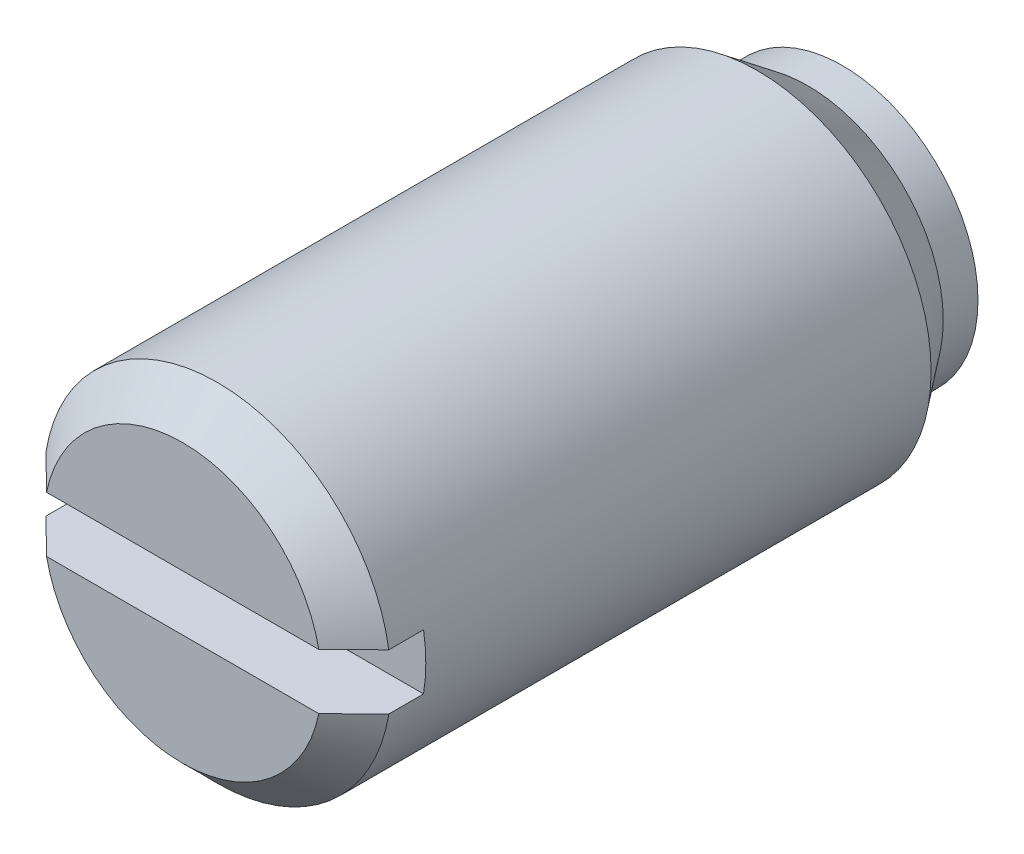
ISO-10303-21;
HEADER;
FILE_DESCRIPTION(('STEP AP214'),'2;1');
FILE_NAME('part.step','',(''),(''),'','','');
FILE_SCHEMA(('AUTOMOTIVE_DESIGN { 1 0 10303 214 1 1 1 1 }'));
ENDSEC;
DATA;
#1=APPLICATION_CONTEXT('core data for automotive mechanical design processes');
#2=APPLICATION_PROTOCOL_DEFINITION('international standard','automotive_design',2000,#1);
#3=PRODUCT_CONTEXT('',#1,'mechanical');
#4=PRODUCT('Part','Part','',(#3));
#5=PRODUCT_RELATED_PRODUCT_CATEGORY('part','',(#4));
#6=PRODUCT_DEFINITION_FORMATION('','',#4);
#7=PRODUCT_DEFINITION_CONTEXT('part definition',#1,'design');
#8=PRODUCT_DEFINITION('design','',#6,#7);
#9=PRODUCT_DEFINITION_SHAPE('','',#8);
#10=(LENGTH_UNIT() NAMED_UNIT(*) SI_UNIT(.MILLI.,.METRE.));
#11=(NAMED_UNIT(*) PLANE_ANGLE_UNIT() SI_UNIT($,.RADIAN.));
#12=(NAMED_UNIT(*) SI_UNIT($,.STERADIAN.) SOLID_ANGLE_UNIT());
#13=UNCERTAINTY_MEASURE_WITH_UNIT(LENGTH_MEASURE(1.E-05),#10,'distance_accuracy_value','');
#14=(GEOMETRIC_REPRESENTATION_CONTEXT(3) GLOBAL_UNCERTAINTY_ASSIGNED_CONTEXT((#13)) GLOBAL_UNIT_ASSIGNED_CONTEXT((#10,
#11,#12)) REPRESENTATION_CONTEXT('',''));
#15=CARTESIAN_POINT('',(0.,0.,0.));
#16=DIRECTION('',(0.,0.,1.));
#17=DIRECTION('',(1.,0.,0.));
#18=AXIS2_PLACEMENT_3D('',#15,#16,#17);
#19=CARTESIAN_POINT('',(0.,0.,1.));
#20=DIRECTION('',(0.,0.,-1.));
#21=DIRECTION('',(-1.,0.,0.));
#22=AXIS2_PLACEMENT_3D('',#19,#20,#21);
#23=CYLINDRICAL_SURFACE('',#22,5.);
#24=CARTESIAN_POINT('',(0.,0.,4.45));
#25=DIRECTION('',(0.,0.,1.));
#26=DIRECTION('',(1.,0.,0.));
#27=AXIS2_PLACEMENT_3D('',#24,#25,#26);
#28=CIRCLE('',#27,5.);
#29=CARTESIAN_POINT('',(5.,0.,4.45));
#30=VERTEX_POINT('',#29);
#31=EDGE_CURVE('E78',#30,#30,#28,.T.);
#32=ORIENTED_EDGE('',*,*,#31,.T.);
#33=EDGE_LOOP('',(#32));
#34=FACE_BOUND('',#33,.T.);
#35=DIRECTION('',(0.,0.,1.));
#36=VECTOR('',#35,1.);
#37=CARTESIAN_POINT('',(-4.93558507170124,0.8,19.));
#38=LINE('',#37,#36);
#39=CARTESIAN_POINT('',(-4.93558507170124,0.8,19.));
#40=VERTEX_POINT('',#39);
#41=CARTESIAN_POINT('',(-4.93558507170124,0.8,20.));
#42=VERTEX_POINT('',#41);
#43=EDGE_CURVE('E87',#40,#42,#38,.T.);
#44=ORIENTED_EDGE('',*,*,#43,.T.);
#45=CARTESIAN_POINT('',(0.,0.,20.));
#46=DIRECTION('',(0.,0.,1.));
#47=DIRECTION('',(1.,0.,0.));
#48=AXIS2_PLACEMENT_3D('',#45,#46,#47);
#49=CIRCLE('',#48,5.);
#50=CARTESIAN_POINT('',(4.93558507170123,0.8,20.));
#51=VERTEX_POINT('',#50);
#52=EDGE_CURVE('E35',#51,#42,#49,.T.);
#53=ORIENTED_EDGE('',*,*,#52,.F.);
#54=DIRECTION('',(0.,0.,1.));
#55=VECTOR('',#54,1.);
#56=CARTESIAN_POINT('',(4.93558507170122,0.8,19.));
#57=LINE('',#56,#55);
#58=CARTESIAN_POINT('',(4.93558507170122,0.8,19.));
#59=VERTEX_POINT('',#58);
#60=EDGE_CURVE('E85',#59,#51,#57,.T.);
#61=ORIENTED_EDGE('',*,*,#60,.F.);
#62=CARTESIAN_POINT('',(0.,0.,19.));
#63=DIRECTION('',(0.,0.,1.));
#64=DIRECTION('',(1.,0.,0.));
#65=AXIS2_PLACEMENT_3D('',#62,#63,#64);
#66=CIRCLE('',#65,5.);
#67=CARTESIAN_POINT('',(4.93558507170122,-0.8,19.));
#68=VERTEX_POINT('',#67);
#69=EDGE_CURVE('E117',#68,#59,#66,.T.);
#70=ORIENTED_EDGE('',*,*,#69,.F.);
#71=DIRECTION('',(0.,0.,1.));
#72=VECTOR('',#71,1.);
#73=CARTESIAN_POINT('',(4.93558507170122,-0.8,19.));
#74=LINE('',#73,#72);
#75=CARTESIAN_POINT('',(4.93558507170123,-0.8,20.));
#76=VERTEX_POINT('',#75);
#77=EDGE_CURVE('E94',#68,#76,#74,.T.);
#78=ORIENTED_EDGE('',*,*,#77,.T.);
#79=CARTESIAN_POINT('',(-4.93558507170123,-0.8,20.));
#80=VERTEX_POINT('',#79);
#81=EDGE_CURVE('E88',#80,#76,#49,.T.);
#82=ORIENTED_EDGE('',*,*,#81,.F.);
#83=DIRECTION('',(0.,0.,1.));
#84=VECTOR('',#83,1.);
#85=CARTESIAN_POINT('',(-4.93558507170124,-0.8,19.));
#86=LINE('',#85,#84);
#87=CARTESIAN_POINT('',(-4.93558507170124,-0.8,19.));
#88=VERTEX_POINT('',#87);
#89=EDGE_CURVE('E99',#88,#80,#86,.T.);
#90=ORIENTED_EDGE('',*,*,#89,.F.);
#91=EDGE_CURVE('E121',#40,#88,#66,.T.);
#92=ORIENTED_EDGE('',*,*,#91,.F.);
#93=EDGE_LOOP('',(#44,#53,#61,#70,#78,#82,#90,#92));
#94=FACE_BOUND('',#93,.T.);
#95=ADVANCED_FACE('F14',(#34,#94),#23,.T.);
#96=CARTESIAN_POINT('',(0.,5.,21.));
#97=DIRECTION('',(0.,0.,1.));
#98=DIRECTION('',(1.,0.,0.));
#99=AXIS2_PLACEMENT_3D('',#96,#97,#98);
#100=PLANE('',#99);
#101=DIRECTION('',(1.,0.,0.));
#102=VECTOR('',#101,1.);
#103=CARTESIAN_POINT('',(-4.93558507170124,0.8,21.));
#104=LINE('',#103,#102);
#105=CARTESIAN_POINT('',(-3.91918358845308,0.8,21.));
#106=VERTEX_POINT('',#105);
#107=CARTESIAN_POINT('',(3.91918358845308,0.8,21.));
#108=VERTEX_POINT('',#107);
#109=EDGE_CURVE('E123',#106,#108,#104,.T.);
#110=ORIENTED_EDGE('',*,*,#109,.T.);
#111=CARTESIAN_POINT('',(0.,0.,21.));
#112=DIRECTION('',(0.,0.,1.));
#113=DIRECTION('',(1.,0.,0.));
#114=AXIS2_PLACEMENT_3D('',#111,#112,#113);
#115=CIRCLE('',#114,4.);
#116=EDGE_CURVE('E73',#108,#106,#115,.T.);
#117=ORIENTED_EDGE('',*,*,#116,.T.);
#118=EDGE_LOOP('',(#110,#117));
#119=FACE_BOUND('',#118,.T.);
#120=ADVANCED_FACE('F165',(#119),#100,.T.);
#121=DIRECTION('',(1.,0.,0.));
#122=VECTOR('',#121,1.);
#123=CARTESIAN_POINT('',(-4.93558507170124,-0.8,21.));
#124=LINE('',#123,#122);
#125=CARTESIAN_POINT('',(-3.91918358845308,-0.8,21.));
#126=VERTEX_POINT('',#125);
#127=CARTESIAN_POINT('',(3.91918358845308,-0.8,21.));
#128=VERTEX_POINT('',#127);
#129=EDGE_CURVE('E125',#126,#128,#124,.T.);
#130=ORIENTED_EDGE('',*,*,#129,.F.);
#131=EDGE_CURVE('E42',#126,#128,#115,.T.);
#132=ORIENTED_EDGE('',*,*,#131,.T.);
#133=EDGE_LOOP('',(#130,#132));
#134=FACE_BOUND('',#133,.T.);
#135=ADVANCED_FACE('F163',(#134),#100,.T.);
#136=CARTESIAN_POINT('',(-4.93558507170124,0.8,19.));
#137=DIRECTION('',(0.,-1.,0.));
#138=DIRECTION('',(1.,0.,0.));
#139=AXIS2_PLACEMENT_3D('',#136,#137,#138);
#140=PLANE('',#139);
#141=ORIENTED_EDGE('',*,*,#60,.T.);
#142=CARTESIAN_POINT('',(10.8888011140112,0.8,14.0818504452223));
#143=CARTESIAN_POINT('',(10.5091335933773,0.799999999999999,14.4604890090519));
#144=CARTESIAN_POINT('',(10.1294208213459,0.799999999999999,14.8390822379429));
#145=CARTESIAN_POINT('',(9.369833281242,0.799999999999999,15.596130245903));
#146=CARTESIAN_POINT('',(8.98995850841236,0.799999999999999,15.9745850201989));
#147=CARTESIAN_POINT('',(8.22971772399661,0.799999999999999,16.7315649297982));
#148=CARTESIAN_POINT('',(7.84935155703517,0.799999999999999,17.1100899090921));
#149=CARTESIAN_POINT('',(7.08830903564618,0.799999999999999,17.8668044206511));
#150=CARTESIAN_POINT('',(6.70763269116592,0.799999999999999,18.2449939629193));
#151=CARTESIAN_POINT('',(5.95065413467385,0.799999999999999,18.996000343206));
#152=CARTESIAN_POINT('',(5.57435851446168,0.799999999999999,19.3688238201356));
#153=CARTESIAN_POINT('',(5.00921367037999,0.799999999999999,19.9273853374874));
#154=CARTESIAN_POINT('',(4.82070618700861,0.799999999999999,20.1134690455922));
#155=CARTESIAN_POINT('',(4.44336739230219,0.799999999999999,20.4853044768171));
#156=CARTESIAN_POINT('',(4.25453608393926,0.799999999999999,20.6710562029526));
#157=CARTESIAN_POINT('',(3.87648764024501,0.799999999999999,21.0419934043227));
#158=CARTESIAN_POINT('',(3.68727072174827,0.799999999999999,21.2271791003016));
#159=CARTESIAN_POINT('',(3.30809823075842,0.799999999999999,21.5968062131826));
#160=CARTESIAN_POINT('',(3.11814263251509,0.799999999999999,21.7812476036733));
#161=CARTESIAN_POINT('',(2.73706890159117,0.8,22.1488675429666));
#162=CARTESIAN_POINT('',(2.54595096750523,0.8,22.3320462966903));
#163=CARTESIAN_POINT('',(2.25760193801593,0.799999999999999,22.6050390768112));
#164=CARTESIAN_POINT('',(2.16120963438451,0.799999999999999,22.6957382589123));
#165=CARTESIAN_POINT('',(1.9676117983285,0.8,22.8762637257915));
#166=CARTESIAN_POINT('',(1.87040628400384,0.8,22.9660900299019));
#167=CARTESIAN_POINT('',(1.74579873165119,0.8,23.0796629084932));
#168=CARTESIAN_POINT('',(1.71896253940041,0.8,23.1040304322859));
#169=CARTESIAN_POINT('',(1.66518446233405,0.799999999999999,23.1526487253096));
#170=CARTESIAN_POINT('',(1.63824257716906,0.8,23.176899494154));
#171=CARTESIAN_POINT('',(1.55723574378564,0.8,23.2494559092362));
#172=CARTESIAN_POINT('',(1.50299247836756,0.8,23.2975630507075));
#173=CARTESIAN_POINT('',(1.39371516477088,0.8,23.3932202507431));
#174=CARTESIAN_POINT('',(1.33867917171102,0.799999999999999,23.4407680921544));
#175=CARTESIAN_POINT('',(1.2277806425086,0.8,23.5348780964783));
#176=CARTESIAN_POINT('',(1.17191822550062,0.8,23.5814403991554));
#177=CARTESIAN_POINT('',(1.06388676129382,0.8,23.6692294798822));
#178=CARTESIAN_POINT('',(1.0118117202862,0.8,23.7105714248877));
#179=CARTESIAN_POINT('',(0.906358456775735,0.799999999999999,23.791554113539));
#180=CARTESIAN_POINT('',(0.852980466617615,0.8,23.8311951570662));
#181=CARTESIAN_POINT('',(0.744493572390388,0.8,23.9078485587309));
#182=CARTESIAN_POINT('',(0.689387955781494,0.8,23.944865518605));
#183=CARTESIAN_POINT('',(0.576673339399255,0.8,24.0148131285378));
#184=CARTESIAN_POINT('',(0.519067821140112,0.8,24.0477492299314));
#185=CARTESIAN_POINT('',(0.408839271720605,0.8,24.1026678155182));
#186=CARTESIAN_POINT('',(0.35667372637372,0.8,24.1255420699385));
#187=CARTESIAN_POINT('',(0.249613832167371,0.8,24.1634394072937));
#188=CARTESIAN_POINT('',(0.194730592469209,0.8,24.1784919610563));
#189=CARTESIAN_POINT('',(0.092296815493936,0.8,24.1959939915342));
#190=CARTESIAN_POINT('',(0.0450481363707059,0.8,24.2001254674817));
#191=CARTESIAN_POINT('',(-0.0493940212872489,0.8,24.1998686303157));
#192=CARTESIAN_POINT('',(-0.0965875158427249,0.8,24.1954848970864));
#193=CARTESIAN_POINT('',(-0.204243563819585,0.8,24.1765456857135));
#194=CARTESIAN_POINT('',(-0.26420199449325,0.8,24.1592205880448));
#195=CARTESIAN_POINT('',(-0.351611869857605,0.8,24.1265666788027));
#196=CARTESIAN_POINT('',(-0.380416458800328,0.8,24.1145209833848));
#197=CARTESIAN_POINT('',(-0.437224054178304,0.8,24.0886662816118));
#198=CARTESIAN_POINT('',(-0.465227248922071,0.8,24.0748576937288));
#199=CARTESIAN_POINT('',(-0.541425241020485,0.8,24.03489806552));
#200=CARTESIAN_POINT('',(-0.588861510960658,0.8,24.007315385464));
#201=CARTESIAN_POINT('',(-0.682018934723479,0.8,23.9493693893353));
#202=CARTESIAN_POINT('',(-0.727738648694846,0.8,23.9190038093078));
#203=CARTESIAN_POINT('',(-0.817970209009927,0.8,23.8563128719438));
#204=CARTESIAN_POINT('',(-0.862478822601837,0.8,23.823982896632));
#205=CARTESIAN_POINT('',(-0.950496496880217,0.8,23.7579849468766));
#206=CARTESIAN_POINT('',(-0.994005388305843,0.8,23.7243167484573));
#207=CARTESIAN_POINT('',(-1.12386825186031,0.8,23.6215076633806));
#208=CARTESIAN_POINT('',(-1.20906998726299,0.8,23.5509148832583));
#209=CARTESIAN_POINT('',(-1.33539455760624,0.8,23.4434624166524));
#210=CARTESIAN_POINT('',(-1.3772220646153,0.8,23.4074151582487));
#211=CARTESIAN_POINT('',(-1.46049378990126,0.8,23.3348814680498));
#212=CARTESIAN_POINT('',(-1.50193802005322,0.8,23.2983950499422));
#213=CARTESIAN_POINT('',(-1.62458947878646,0.8,23.1895074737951));
#214=CARTESIAN_POINT('',(-1.7053569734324,0.8,23.116611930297));
#215=CARTESIAN_POINT('',(-1.86607972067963,0.8,22.96992923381));
#216=CARTESIAN_POINT('',(-1.94603494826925,0.8,22.8961420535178));
#217=CARTESIAN_POINT('',(-2.18505673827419,0.8,22.6738450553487));
#218=CARTESIAN_POINT('',(-2.34326459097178,0.8,22.5244131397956));
#219=CARTESIAN_POINT('',(-2.65855067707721,0.8,22.224096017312));
#220=CARTESIAN_POINT('',(-2.81562780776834,0.8,22.0732096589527));
#221=CARTESIAN_POINT('',(-3.12898101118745,0.8,21.7706248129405));
#222=CARTESIAN_POINT('',(-3.28525712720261,0.8,21.6189263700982));
#223=CARTESIAN_POINT('',(-3.5963235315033,0.8,21.3159372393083));
#224=CARTESIAN_POINT('',(-3.7511170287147,0.8,21.1646498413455));
#225=CARTESIAN_POINT('',(-4.06034778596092,0.8,20.861707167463));
#226=CARTESIAN_POINT('',(-4.2147850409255,0.8,20.7100518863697));
#227=CARTESIAN_POINT('',(-4.67761164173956,0.8,20.2547991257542));
#228=CARTESIAN_POINT('',(-4.98561923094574,0.8,19.9508136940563));
#229=CARTESIAN_POINT('',(-5.75919415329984,0.8,19.1859244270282));
#230=CARTESIAN_POINT('',(-6.22439714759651,0.8,18.7246524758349));
#231=CARTESIAN_POINT('',(-7.15421506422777,0.8,17.801399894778));
#232=CARTESIAN_POINT('',(-7.61882990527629,0.8,17.3394191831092));
#233=CARTESIAN_POINT('',(-8.5511707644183,0.8,16.4116140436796));
#234=CARTESIAN_POINT('',(-9.01889396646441,0.8,15.9457867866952));
#235=CARTESIAN_POINT('',(-9.95403142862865,0.8,15.0139427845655));
#236=CARTESIAN_POINT('',(-10.4214457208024,0.8,14.5479260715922));
#237=CARTESIAN_POINT('',(-10.8888011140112,0.8,14.0818504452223));
#238=B_SPLINE_CURVE_WITH_KNOTS('',3,(#142,#143,#144,#145,#146,#147,#148,#149,#150,#151,#152,
#153,#154,#155,#156,#157,#158,#159,#160,#161,#162,#163,#164,#165,#166,#167,#168,#169,#170,#171,
#172,#173,#174,#175,#176,#177,#178,#179,#180,#181,#182,#183,#184,#185,#186,#187,#188,#189,#190,
#191,#192,#193,#194,#195,#196,#197,#198,#199,#200,#201,#202,#203,#204,#205,#206,#207,#208,#209,
#210,#211,#212,#213,#214,#215,#216,#217,#218,#219,#220,#221,#222,#223,#224,#225,#226,#227,#228,
#229,#230,#231,#232,#233,#234,#235,#236,#237),.UNSPECIFIED.,.F.,.F.,(4,2,2,2,2,2,2,2,2,2,2,2,2,
2,2,2,2,2,2,2,2,2,2,2,2,2,2,2,2,2,2,2,2,2,2,2,2,2,2,2,2,2,2,2,2,2,2,4),(0.,1.60861164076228,
3.21727431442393,4.82713013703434,6.43693621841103,8.02607381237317,8.82071806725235,
9.61535506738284,10.4096273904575,11.2039276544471,11.9980958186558,12.3951576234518,
12.7922106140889,12.9009559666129,13.0097016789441,13.2272047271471,13.4453891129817,
13.6635423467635,13.8629906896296,14.062403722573,14.261457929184,14.4602432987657,
14.6307411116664,14.8005917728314,14.9421426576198,15.0836174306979,15.2696662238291,
15.3632999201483,15.456911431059,15.6213715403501,15.7859666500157,15.9509649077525,
16.1159908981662,16.4478481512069,16.6135001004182,16.7791468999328,17.1055320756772,
17.4319272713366,18.0847775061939,18.7381958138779,19.3915784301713,20.0409159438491,
20.6902626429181,21.9885223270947,23.9538888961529,25.9195025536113,27.8998661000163,
29.8799743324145),.UNSPECIFIED.);
#239=EDGE_CURVE('E70',#51,#108,#238,.T.);
#240=ORIENTED_EDGE('',*,*,#239,.T.);
#241=ORIENTED_EDGE('',*,*,#109,.F.);
#242=EDGE_CURVE('E79',#106,#42,#238,.T.);
#243=ORIENTED_EDGE('',*,*,#242,.T.);
#244=ORIENTED_EDGE('',*,*,#43,.F.);
#245=DIRECTION('',(1.,0.,0.));
#246=VECTOR('',#245,1.);
#247=CARTESIAN_POINT('',(-4.93558507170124,0.8,19.));
#248=LINE('',#247,#246);
#249=EDGE_CURVE('E93',#40,#59,#248,.T.);
#250=ORIENTED_EDGE('',*,*,#249,.T.);
#251=EDGE_LOOP('',(#141,#240,#241,#243,#244,#250));
#252=FACE_BOUND('',#251,.T.);
#253=ADVANCED_FACE('F91',(#252),#140,.T.);
#254=CARTESIAN_POINT('',(-4.93558507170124,-0.8,19.));
#255=DIRECTION('',(0.,-1.,0.));
#256=DIRECTION('',(1.,0.,0.));
#257=AXIS2_PLACEMENT_3D('',#254,#255,#256);
#258=PLANE('',#257);
#259=CARTESIAN_POINT('',(10.8888011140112,-0.8,14.0818504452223));
#260=CARTESIAN_POINT('',(10.5091335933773,-0.800000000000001,14.4604890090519));
#261=CARTESIAN_POINT('',(10.1294208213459,-0.800000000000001,14.8390822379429));
#262=CARTESIAN_POINT('',(9.369833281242,-0.800000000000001,15.5961302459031));
#263=CARTESIAN_POINT('',(8.98995850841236,-0.800000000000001,15.9745850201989));
#264=CARTESIAN_POINT('',(8.2297177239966,-0.800000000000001,16.7315649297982));
#265=CARTESIAN_POINT('',(7.84935155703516,-0.800000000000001,17.1100899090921));
#266=CARTESIAN_POINT('',(7.08830903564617,-0.800000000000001,17.8668044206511));
#267=CARTESIAN_POINT('',(6.70763269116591,-0.800000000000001,18.2449939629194));
#268=CARTESIAN_POINT('',(5.95065413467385,-0.800000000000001,18.996000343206));
#269=CARTESIAN_POINT('',(5.57435851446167,-0.800000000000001,19.3688238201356));
#270=CARTESIAN_POINT('',(5.00921367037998,-0.800000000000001,19.9273853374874));
#271=CARTESIAN_POINT('',(4.82070618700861,-0.800000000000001,20.1134690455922));
#272=CARTESIAN_POINT('',(4.44336739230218,-0.800000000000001,20.4853044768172));
#273=CARTESIAN_POINT('',(4.25453608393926,-0.800000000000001,20.6710562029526));
#274=CARTESIAN_POINT('',(3.87648764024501,-0.800000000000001,21.0419934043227));
#275=CARTESIAN_POINT('',(3.68727072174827,-0.800000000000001,21.2271791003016));
#276=CARTESIAN_POINT('',(3.30809823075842,-0.800000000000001,21.5968062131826));
#277=CARTESIAN_POINT('',(3.11814263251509,-0.800000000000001,21.7812476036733));
#278=CARTESIAN_POINT('',(2.73706890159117,-0.8,22.1488675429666));
#279=CARTESIAN_POINT('',(2.54595096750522,-0.8,22.3320462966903));
#280=CARTESIAN_POINT('',(2.25760193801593,-0.800000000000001,22.6050390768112));
#281=CARTESIAN_POINT('',(2.16120963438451,-0.800000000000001,22.6957382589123));
#282=CARTESIAN_POINT('',(1.9676117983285,-0.8,22.8762637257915));
#283=CARTESIAN_POINT('',(1.87040628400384,-0.8,22.9660900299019));
#284=CARTESIAN_POINT('',(1.74579873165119,-0.8,23.0796629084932));
#285=CARTESIAN_POINT('',(1.71896253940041,-0.8,23.1040304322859));
#286=CARTESIAN_POINT('',(1.66518446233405,-0.800000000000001,23.1526487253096));
#287=CARTESIAN_POINT('',(1.63824257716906,-0.8,23.176899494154));
#288=CARTESIAN_POINT('',(1.55723574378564,-0.8,23.2494559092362));
#289=CARTESIAN_POINT('',(1.50299247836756,-0.8,23.2975630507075));
#290=CARTESIAN_POINT('',(1.39371516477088,-0.8,23.3932202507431));
#291=CARTESIAN_POINT('',(1.33867917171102,-0.800000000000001,23.4407680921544));
#292=CARTESIAN_POINT('',(1.2277806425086,-0.8,23.5348780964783));
#293=CARTESIAN_POINT('',(1.17191822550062,-0.8,23.5814403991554));
#294=CARTESIAN_POINT('',(1.06388676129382,-0.8,23.6692294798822));
#295=CARTESIAN_POINT('',(1.01181172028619,-0.8,23.7105714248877));
#296=CARTESIAN_POINT('',(0.906358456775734,-0.800000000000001,23.791554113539));
#297=CARTESIAN_POINT('',(0.852980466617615,-0.8,23.8311951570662));
#298=CARTESIAN_POINT('',(0.744493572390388,-0.8,23.9078485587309));
#299=CARTESIAN_POINT('',(0.689387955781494,-0.8,23.944865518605));
#300=CARTESIAN_POINT('',(0.576673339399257,-0.8,24.0148131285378));
#301=CARTESIAN_POINT('',(0.519067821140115,-0.8,24.0477492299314));
#302=CARTESIAN_POINT('',(0.40883927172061,-0.8,24.1026678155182));
#303=CARTESIAN_POINT('',(0.356673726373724,-0.8,24.1255420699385));
#304=CARTESIAN_POINT('',(0.249613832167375,-0.8,24.1634394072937));
#305=CARTESIAN_POINT('',(0.194730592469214,-0.8,24.1784919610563));
#306=CARTESIAN_POINT('',(0.0922968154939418,-0.8,24.1959939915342));
#307=CARTESIAN_POINT('',(0.0450481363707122,-0.8,24.2001254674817));
#308=CARTESIAN_POINT('',(-0.0493940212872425,-0.8,24.1998686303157));
#309=CARTESIAN_POINT('',(-0.0965875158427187,-0.8,24.1954848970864));
#310=CARTESIAN_POINT('',(-0.204243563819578,-0.8,24.1765456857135));
#311=CARTESIAN_POINT('',(-0.264201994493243,-0.8,24.1592205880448));
#312=CARTESIAN_POINT('',(-0.351611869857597,-0.8,24.1265666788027));
#313=CARTESIAN_POINT('',(-0.380416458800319,-0.8,24.1145209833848));
#314=CARTESIAN_POINT('',(-0.437224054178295,-0.8,24.0886662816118));
#315=CARTESIAN_POINT('',(-0.465227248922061,-0.8,24.0748576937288));
#316=CARTESIAN_POINT('',(-0.541425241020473,-0.8,24.03489806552));
#317=CARTESIAN_POINT('',(-0.588861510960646,-0.8,24.007315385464));
#318=CARTESIAN_POINT('',(-0.682018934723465,-0.8,23.9493693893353));
#319=CARTESIAN_POINT('',(-0.727738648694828,-0.8,23.9190038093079));
#320=CARTESIAN_POINT('',(-0.817970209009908,-0.8,23.8563128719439));
#321=CARTESIAN_POINT('',(-0.862478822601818,-0.8,23.823982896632));
#322=CARTESIAN_POINT('',(-0.950496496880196,-0.8,23.7579849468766));
#323=CARTESIAN_POINT('',(-0.994005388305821,-0.8,23.7243167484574));
#324=CARTESIAN_POINT('',(-1.12386825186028,-0.8,23.6215076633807));
#325=CARTESIAN_POINT('',(-1.20906998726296,-0.8,23.5509148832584));
#326=CARTESIAN_POINT('',(-1.33539455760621,-0.8,23.4434624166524));
#327=CARTESIAN_POINT('',(-1.37722206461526,-0.8,23.4074151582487));
#328=CARTESIAN_POINT('',(-1.46049378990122,-0.8,23.3348814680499));
#329=CARTESIAN_POINT('',(-1.50193802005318,-0.8,23.2983950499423));
#330=CARTESIAN_POINT('',(-1.62458947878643,-0.8,23.1895074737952));
#331=CARTESIAN_POINT('',(-1.70535697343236,-0.8,23.116611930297));
#332=CARTESIAN_POINT('',(-1.86607972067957,-0.8,22.96992923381));
#333=CARTESIAN_POINT('',(-1.94603494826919,-0.8,22.8961420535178));
#334=CARTESIAN_POINT('',(-2.18505673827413,-0.8,22.6738450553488));
#335=CARTESIAN_POINT('',(-2.34326459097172,-0.8,22.5244131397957));
#336=CARTESIAN_POINT('',(-2.65855067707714,-0.8,22.2240960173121));
#337=CARTESIAN_POINT('',(-2.81562780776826,-0.8,22.0732096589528));
#338=CARTESIAN_POINT('',(-3.12898101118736,-0.8,21.7706248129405));
#339=CARTESIAN_POINT('',(-3.28525712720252,-0.8,21.6189263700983));
#340=CARTESIAN_POINT('',(-3.5963235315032,-0.8,21.3159372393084));
#341=CARTESIAN_POINT('',(-3.75111702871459,-0.8,21.1646498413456));
#342=CARTESIAN_POINT('',(-4.0603477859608,-0.8,20.8617071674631));
#343=CARTESIAN_POINT('',(-4.21478504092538,-0.8,20.7100518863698));
#344=CARTESIAN_POINT('',(-4.67761164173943,-0.8,20.2547991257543));
#345=CARTESIAN_POINT('',(-4.98561923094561,-0.8,19.9508136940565));
#346=CARTESIAN_POINT('',(-5.75919415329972,-0.8,19.1859244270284));
#347=CARTESIAN_POINT('',(-6.22439714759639,-0.8,18.7246524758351));
#348=CARTESIAN_POINT('',(-7.15421506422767,-0.8,17.8013998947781));
#349=CARTESIAN_POINT('',(-7.6188299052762,-0.8,17.3394191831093));
#350=CARTESIAN_POINT('',(-8.55117076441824,-0.8,16.4116140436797));
#351=CARTESIAN_POINT('',(-9.01889396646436,-0.8,15.9457867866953));
#352=CARTESIAN_POINT('',(-9.95403142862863,-0.8,15.0139427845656));
#353=CARTESIAN_POINT('',(-10.4214457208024,-0.8,14.5479260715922));
#354=CARTESIAN_POINT('',(-10.8888011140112,-0.8,14.0818504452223));
#355=B_SPLINE_CURVE_WITH_KNOTS('',3,(#259,#260,#261,#262,#263,#264,#265,#266,#267,#268,#269,
#270,#271,#272,#273,#274,#275,#276,#277,#278,#279,#280,#281,#282,#283,#284,#285,#286,#287,#288,
#289,#290,#291,#292,#293,#294,#295,#296,#297,#298,#299,#300,#301,#302,#303,#304,#305,#306,#307,
#308,#309,#310,#311,#312,#313,#314,#315,#316,#317,#318,#319,#320,#321,#322,#323,#324,#325,#326,
#327,#328,#329,#330,#331,#332,#333,#334,#335,#336,#337,#338,#339,#340,#341,#342,#343,#344,#345,
#346,#347,#348,#349,#350,#351,#352,#353,#354),.UNSPECIFIED.,.F.,.F.,(4,2,2,2,2,2,2,2,2,2,2,2,2,
2,2,2,2,2,2,2,2,2,2,2,2,2,2,2,2,2,2,2,2,2,2,2,2,2,2,2,2,2,2,2,2,2,2,4),(0.,1.60861164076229,
3.21727431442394,4.82713013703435,6.43693621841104,8.02607381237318,8.82071806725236,
9.61535506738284,10.4096273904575,11.2039276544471,11.9980958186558,12.3951576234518,
12.7922106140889,12.9009559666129,13.0097016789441,13.2272047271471,13.4453891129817,
13.6635423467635,13.8629906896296,14.062403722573,14.261457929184,14.4602432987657,
14.6307411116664,14.8005917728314,14.9421426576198,15.0836174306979,15.2696662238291,
15.3632999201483,15.456911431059,15.6213715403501,15.7859666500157,15.9509649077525,
16.1159908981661,16.4478481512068,16.6135001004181,16.7791468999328,17.1055320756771,
17.4319272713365,18.0847775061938,18.7381958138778,19.3915784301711,20.040915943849,
20.690262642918,21.9885223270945,23.9538888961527,25.9195025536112,27.8998661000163,
29.8799743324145),.UNSPECIFIED.);
#356=EDGE_CURVE('E9',#76,#128,#355,.T.);
#357=ORIENTED_EDGE('',*,*,#356,.F.);
#358=ORIENTED_EDGE('',*,*,#77,.F.);
#359=DIRECTION('',(1.,0.,0.));
#360=VECTOR('',#359,1.);
#361=CARTESIAN_POINT('',(-4.93558507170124,-0.8,19.));
#362=LINE('',#361,#360);
#363=EDGE_CURVE('E116',#88,#68,#362,.T.);
#364=ORIENTED_EDGE('',*,*,#363,.F.);
#365=ORIENTED_EDGE('',*,*,#89,.T.);
#366=EDGE_CURVE('E18',#126,#80,#355,.T.);
#367=ORIENTED_EDGE('',*,*,#366,.F.);
#368=ORIENTED_EDGE('',*,*,#129,.T.);
#369=EDGE_LOOP('',(#357,#358,#364,#365,#367,#368));
#370=FACE_BOUND('',#369,.T.);
#371=ADVANCED_FACE('F115',(#370),#258,.F.);
#372=CARTESIAN_POINT('',(0.,0.,19.));
#373=DIRECTION('',(0.,0.,1.));
#374=DIRECTION('',(1.,0.,0.));
#375=AXIS2_PLACEMENT_3D('',#372,#373,#374);
#376=PLANE('',#375);
#377=ORIENTED_EDGE('',*,*,#91,.T.);
#378=ORIENTED_EDGE('',*,*,#363,.T.);
#379=ORIENTED_EDGE('',*,*,#69,.T.);
#380=ORIENTED_EDGE('',*,*,#249,.F.);
#381=EDGE_LOOP('',(#377,#378,#379,#380));
#382=FACE_BOUND('',#381,.T.);
#383=ADVANCED_FACE('F153',(#382),#376,.T.);
#384=CARTESIAN_POINT('',(0.,0.,23.370264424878));
#385=DIRECTION('',(0.,0.,1.));
#386=DIRECTION('',(1.,0.,0.));
#387=AXIS2_PLACEMENT_3D('',#384,#385,#386);
#388=CYLINDRICAL_SURFACE('',#387,3.9);
#389=CARTESIAN_POINT('',(0.,0.,2.));
#390=DIRECTION('',(0.,0.,1.));
#391=DIRECTION('',(1.,0.,0.));
#392=AXIS2_PLACEMENT_3D('',#389,#390,#391);
#393=CIRCLE('',#392,3.9);
#394=CARTESIAN_POINT('',(3.9,0.,2.));
#395=VERTEX_POINT('',#394);
#396=EDGE_CURVE('E127',#395,#395,#393,.T.);
#397=ORIENTED_EDGE('',*,*,#396,.T.);
#398=EDGE_LOOP('',(#397));
#399=FACE_BOUND('',#398,.T.);
#400=CARTESIAN_POINT('',(0.,0.,3.));
#401=DIRECTION('',(0.,0.,1.));
#402=DIRECTION('',(1.,0.,0.));
#403=AXIS2_PLACEMENT_3D('',#400,#401,#402);
#404=CIRCLE('',#403,3.9);
#405=CARTESIAN_POINT('',(3.9,0.,3.));
#406=VERTEX_POINT('',#405);
#407=EDGE_CURVE('E130',#406,#406,#404,.T.);
#408=ORIENTED_EDGE('',*,*,#407,.F.);
#409=EDGE_LOOP('',(#408));
#410=FACE_BOUND('',#409,.T.);
#411=ADVANCED_FACE('F149',(#399,#410),#388,.T.);
#412=CARTESIAN_POINT('',(0.,0.,4.45));
#413=DIRECTION('',(0.,0.,1.));
#414=DIRECTION('',(1.,0.,0.));
#415=AXIS2_PLACEMENT_3D('',#412,#413,#414);
#416=CONICAL_SURFACE('',#415,5.,0.648995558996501);
#417=ORIENTED_EDGE('',*,*,#407,.T.);
#418=EDGE_LOOP('',(#417));
#419=FACE_BOUND('',#418,.T.);
#420=ORIENTED_EDGE('',*,*,#31,.F.);
#421=EDGE_LOOP('',(#420));
#422=FACE_BOUND('',#421,.T.);
#423=ADVANCED_FACE('F145',(#419,#422),#416,.T.);
#424=CARTESIAN_POINT('',(0.,0.,3.));
#425=DIRECTION('',(-1.,0.,0.));
#426=DIRECTION('',(0.,0.,1.));
#427=AXIS2_PLACEMENT_3D('',#424,#425,#426);
#428=SPHERICAL_SURFACE('',#427,3.);
#429=CARTESIAN_POINT('',(0.,0.,3.));
#430=DIRECTION('',(0.,0.,-1.));
#431=DIRECTION('',(-1.,0.,0.));
#432=AXIS2_PLACEMENT_3D('',#429,#430,#431);
#433=SPHERICAL_SURFACE('',#432,3.);
#434=CARTESIAN_POINT('',(0.,0.,2.));
#435=DIRECTION('',(0.,0.,-1.));
#436=DIRECTION('',(-1.,0.,0.));
#437=AXIS2_PLACEMENT_3D('',#434,#435,#436);
#438=CIRCLE('',#437,2.82842712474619);
#439=CARTESIAN_POINT('',(-2.8284271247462,0.,2.));
#440=VERTEX_POINT('',#439);
#441=EDGE_CURVE('E96',#440,#440,#438,.T.);
#442=ORIENTED_EDGE('',*,*,#441,.T.);
#443=EDGE_LOOP('',(#442));
#444=FACE_BOUND('',#443,.T.);
#445=ADVANCED_FACE('F16',(#444),#433,.T.);
#446=CARTESIAN_POINT('',(0.,2.82842712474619,2.));
#447=DIRECTION('',(0.,0.,-1.));
#448=DIRECTION('',(-1.,0.,0.));
#449=AXIS2_PLACEMENT_3D('',#446,#447,#448);
#450=PLANE('',#449);
#451=ORIENTED_EDGE('',*,*,#441,.F.);
#452=EDGE_LOOP('',(#451));
#453=FACE_BOUND('',#452,.T.);
#454=ORIENTED_EDGE('',*,*,#396,.F.);
#455=EDGE_LOOP('',(#454));
#456=FACE_BOUND('',#455,.T.);
#457=ADVANCED_FACE('F172',(#453,#456),#450,.T.);
#458=CARTESIAN_POINT('',(0.,0.,21.));
#459=DIRECTION('',(0.,0.,-1.));
#460=DIRECTION('',(-1.,0.,0.));
#461=AXIS2_PLACEMENT_3D('',#458,#459,#460);
#462=CONICAL_SURFACE('',#461,4.,0.785398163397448);
#463=ORIENTED_EDGE('',*,*,#356,.T.);
#464=ORIENTED_EDGE('',*,*,#131,.F.);
#465=ORIENTED_EDGE('',*,*,#366,.T.);
#466=ORIENTED_EDGE('',*,*,#81,.T.);
#467=EDGE_LOOP('',(#463,#464,#465,#466));
#468=FACE_BOUND('',#467,.T.);
#469=ADVANCED_FACE('F106',(#468),#462,.T.);
#470=ORIENTED_EDGE('',*,*,#52,.T.);
#471=ORIENTED_EDGE('',*,*,#242,.F.);
#472=ORIENTED_EDGE('',*,*,#116,.F.);
#473=ORIENTED_EDGE('',*,*,#239,.F.);
#474=EDGE_LOOP('',(#470,#471,#472,#473));
#475=FACE_BOUND('',#474,.T.);
#476=ADVANCED_FACE('F71',(#475),#462,.T.);
#477=CLOSED_SHELL('',(#95,#120,#135,#253,#371,#383,#411,#423,#445,#457,#469,#476));
#478=MANIFOLD_SOLID_BREP('B1',#477);
#479=ADVANCED_BREP_SHAPE_REPRESENTATION('',(#18,#478),#14);
#480=SHAPE_DEFINITION_REPRESENTATION(#9,#479);
ENDSEC;
END-ISO-10303-21;
